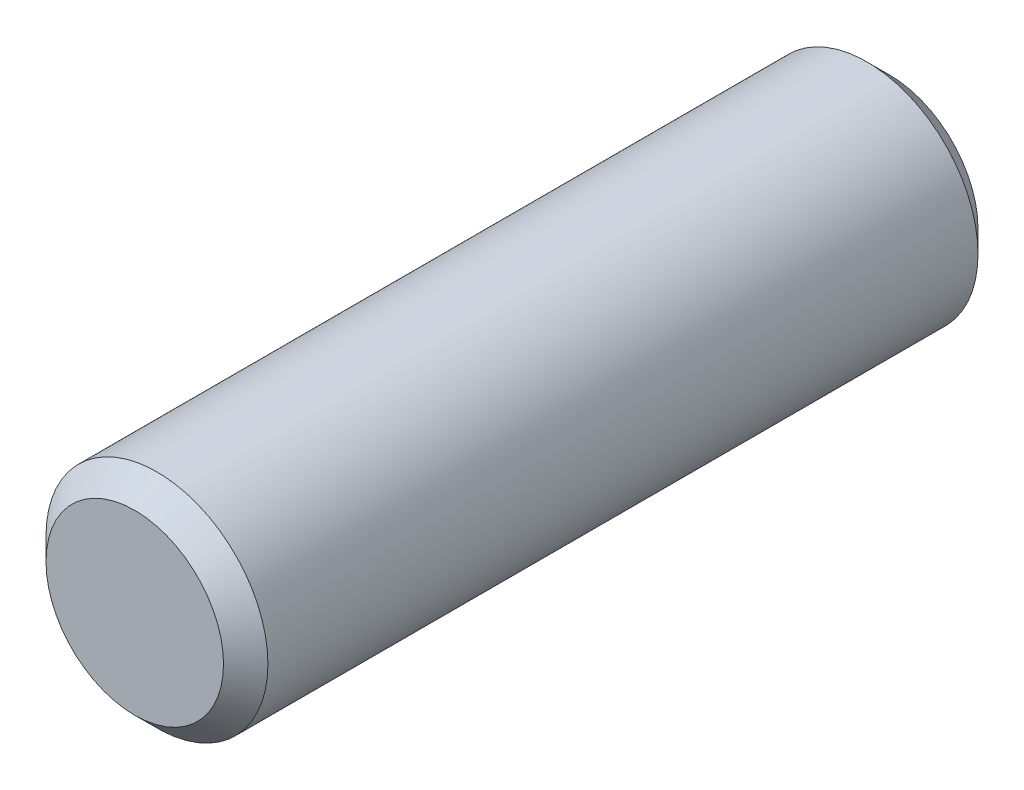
from build123d import *

# Parameters (mm, degrees)
ESQUISSE1_R          = 2.5
BASE_EXTRUSION_DEPTH = 8.5
CHANFREIN1_SIZE      = 0.5


with BuildPart() as part:
    # Esquisse1 → Base-Extrusion (new, symmetric)
    with BuildSketch(Plane.XY):
        Circle(ESQUISSE1_R)
    extrude(amount=BASE_EXTRUSION_DEPTH, both=True)

    # Chanfrein1
    chanfrein1_edges = [part.edges().sort_by_distance(p)[0] for p in [
        (-2.5, 0, -8.5),
        (-2.5, 0, 8.5),
    ]]
    chamfer(chanfrein1_edges, length=CHANFREIN1_SIZE)


solid = part.part
